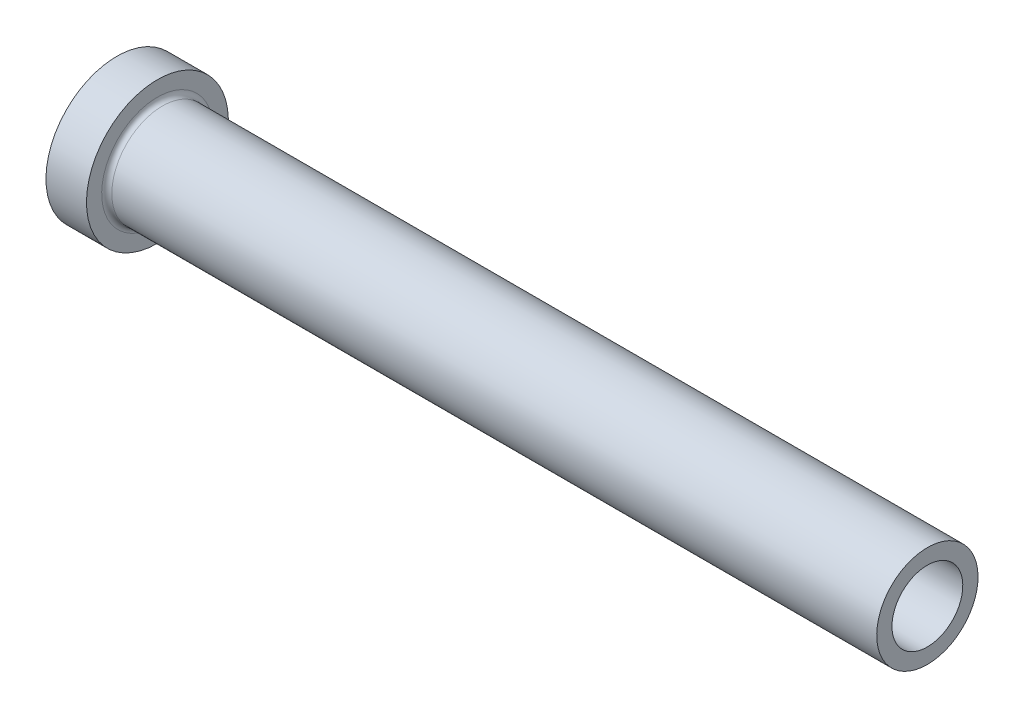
from build123d import *


with BuildPart() as part:
    # Sketch1 → Revolve1 (revolve)
    with BuildSketch(Plane.XY, mode=Mode.PRIVATE) as revolve1_sk:
        with BuildLine():
            Line((-5.1e-08, 6.753860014), (-5.1e-08, 2.580322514))
            Line((-5.1e-08, 2.580322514), (1.190624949, 1.3896975))
            Line((1.190624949, 1.3896975), (69.109421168, 1.3896975))
            Line((69.109421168, 1.3896975), (69.849999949, 1.191260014))
            Line((69.849999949, 1.191260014), (126.999999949, 1.191260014))
            Line((126.999999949, 1.191260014), (126.999999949, 3.578860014))
            Line((126.999999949, 3.578860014), (7.143749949, 3.578860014))
            ThreePointArc((7.143749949, 3.578860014), (6.582483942, 3.811344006), (6.349999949, 4.372610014))
            Line((6.349999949, 4.372610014), (6.349999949, 6.753860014))
            Line((6.349999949, 6.753860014), (-5.1e-08, 6.753860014))
        make_face()
    revolve(revolve1_sk.sketch.rotate(Axis((126.999999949, -4.358639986, 0), (-1, 0, 0)), 180), axis=Axis((126.999999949, -4.358639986, 0), (-1, 0, 0)))


solid = part.part
